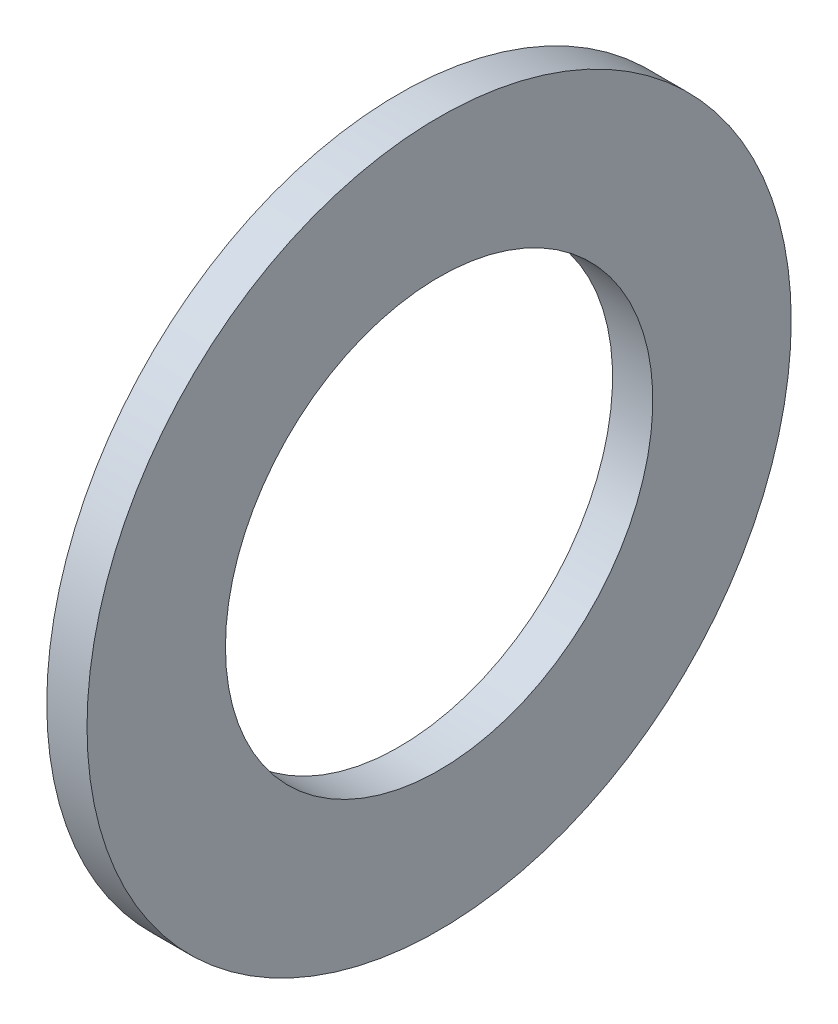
ISO-10303-21;
HEADER;
FILE_DESCRIPTION(('STEP AP214'),'2;1');
FILE_NAME('part.step','',(''),(''),'','','');
FILE_SCHEMA(('AUTOMOTIVE_DESIGN { 1 0 10303 214 1 1 1 1 }'));
ENDSEC;
DATA;
#1=APPLICATION_CONTEXT('core data for automotive mechanical design processes');
#2=APPLICATION_PROTOCOL_DEFINITION('international standard','automotive_design',2000,#1);
#3=PRODUCT_CONTEXT('',#1,'mechanical');
#4=PRODUCT('Part','Part','',(#3));
#5=PRODUCT_RELATED_PRODUCT_CATEGORY('part','',(#4));
#6=PRODUCT_DEFINITION_FORMATION('','',#4);
#7=PRODUCT_DEFINITION_CONTEXT('part definition',#1,'design');
#8=PRODUCT_DEFINITION('design','',#6,#7);
#9=PRODUCT_DEFINITION_SHAPE('','',#8);
#10=(LENGTH_UNIT() NAMED_UNIT(*) SI_UNIT(.MILLI.,.METRE.));
#11=(NAMED_UNIT(*) PLANE_ANGLE_UNIT() SI_UNIT($,.RADIAN.));
#12=(NAMED_UNIT(*) SI_UNIT($,.STERADIAN.) SOLID_ANGLE_UNIT());
#13=UNCERTAINTY_MEASURE_WITH_UNIT(LENGTH_MEASURE(1.E-05),#10,'distance_accuracy_value','');
#14=(GEOMETRIC_REPRESENTATION_CONTEXT(3) GLOBAL_UNCERTAINTY_ASSIGNED_CONTEXT((#13)) GLOBAL_UNIT_ASSIGNED_CONTEXT((#10,
#11,#12)) REPRESENTATION_CONTEXT('',''));
#15=CARTESIAN_POINT('',(0.,0.,0.));
#16=DIRECTION('',(0.,0.,1.));
#17=DIRECTION('',(1.,0.,0.));
#18=AXIS2_PLACEMENT_3D('',#15,#16,#17);
#19=CARTESIAN_POINT('',(-34.9249999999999,0.,0.));
#20=DIRECTION('',(-1.,0.,0.));
#21=DIRECTION('',(0.,0.,1.));
#22=AXIS2_PLACEMENT_3D('',#19,#20,#21);
#23=CYLINDRICAL_SURFACE('',#22,13.4874);
#24=CARTESIAN_POINT('',(0.,0.,0.));
#25=DIRECTION('',(-1.,0.,0.));
#26=DIRECTION('',(0.,0.,1.));
#27=AXIS2_PLACEMENT_3D('',#24,#25,#26);
#28=CIRCLE('',#27,13.4874);
#29=CARTESIAN_POINT('',(0.,0.,13.4874));
#30=VERTEX_POINT('',#29);
#31=EDGE_CURVE('E10',#30,#30,#28,.T.);
#32=ORIENTED_EDGE('',*,*,#31,.F.);
#33=EDGE_LOOP('',(#32));
#34=FACE_BOUND('',#33,.T.);
#35=CARTESIAN_POINT('',(-2.54,0.,0.));
#36=DIRECTION('',(-1.,0.,0.));
#37=DIRECTION('',(0.,0.,1.));
#38=AXIS2_PLACEMENT_3D('',#35,#36,#37);
#39=CIRCLE('',#38,13.4874);
#40=CARTESIAN_POINT('',(-2.54,0.,13.4874));
#41=VERTEX_POINT('',#40);
#42=EDGE_CURVE('E46',#41,#41,#39,.T.);
#43=ORIENTED_EDGE('',*,*,#42,.T.);
#44=EDGE_LOOP('',(#43));
#45=FACE_BOUND('',#44,.T.);
#46=ADVANCED_FACE('F32',(#34,#45),#23,.F.);
#47=CARTESIAN_POINT('',(0.,13.4874,0.));
#48=DIRECTION('',(-1.,0.,0.));
#49=DIRECTION('',(0.,0.,1.));
#50=AXIS2_PLACEMENT_3D('',#47,#48,#49);
#51=PLANE('',#50);
#52=CARTESIAN_POINT('',(0.,0.,0.));
#53=DIRECTION('',(-1.,0.,0.));
#54=DIRECTION('',(0.,0.,1.));
#55=AXIS2_PLACEMENT_3D('',#52,#53,#54);
#56=CIRCLE('',#55,22.225);
#57=CARTESIAN_POINT('',(0.,0.,22.225));
#58=VERTEX_POINT('',#57);
#59=EDGE_CURVE('E38',#58,#58,#56,.T.);
#60=ORIENTED_EDGE('',*,*,#59,.F.);
#61=EDGE_LOOP('',(#60));
#62=FACE_BOUND('',#61,.T.);
#63=ORIENTED_EDGE('',*,*,#31,.T.);
#64=EDGE_LOOP('',(#63));
#65=FACE_BOUND('',#64,.T.);
#66=ADVANCED_FACE('F61',(#62,#65),#51,.F.);
#67=CARTESIAN_POINT('',(-34.9249999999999,0.,0.));
#68=DIRECTION('',(-1.,0.,0.));
#69=DIRECTION('',(0.,0.,1.));
#70=AXIS2_PLACEMENT_3D('',#67,#68,#69);
#71=CYLINDRICAL_SURFACE('',#70,22.225);
#72=CARTESIAN_POINT('',(-2.54,0.,0.));
#73=DIRECTION('',(-1.,0.,0.));
#74=DIRECTION('',(0.,0.,1.));
#75=AXIS2_PLACEMENT_3D('',#72,#73,#74);
#76=CIRCLE('',#75,22.225);
#77=CARTESIAN_POINT('',(-2.54,0.,22.225));
#78=VERTEX_POINT('',#77);
#79=EDGE_CURVE('E42',#78,#78,#76,.T.);
#80=ORIENTED_EDGE('',*,*,#79,.F.);
#81=EDGE_LOOP('',(#80));
#82=FACE_BOUND('',#81,.T.);
#83=ORIENTED_EDGE('',*,*,#59,.T.);
#84=EDGE_LOOP('',(#83));
#85=FACE_BOUND('',#84,.T.);
#86=ADVANCED_FACE('F56',(#82,#85),#71,.T.);
#87=CARTESIAN_POINT('',(-2.54,22.225,0.));
#88=DIRECTION('',(1.,0.,0.));
#89=DIRECTION('',(0.,0.,-1.));
#90=AXIS2_PLACEMENT_3D('',#87,#88,#89);
#91=PLANE('',#90);
#92=ORIENTED_EDGE('',*,*,#42,.F.);
#93=EDGE_LOOP('',(#92));
#94=FACE_BOUND('',#93,.T.);
#95=ORIENTED_EDGE('',*,*,#79,.T.);
#96=EDGE_LOOP('',(#95));
#97=FACE_BOUND('',#96,.T.);
#98=ADVANCED_FACE('F53',(#94,#97),#91,.F.);
#99=CLOSED_SHELL('',(#46,#66,#86,#98));
#100=MANIFOLD_SOLID_BREP('B2',#99);
#101=ADVANCED_BREP_SHAPE_REPRESENTATION('',(#18,#100),#14);
#102=SHAPE_DEFINITION_REPRESENTATION(#9,#101);
ENDSEC;
END-ISO-10303-21;
